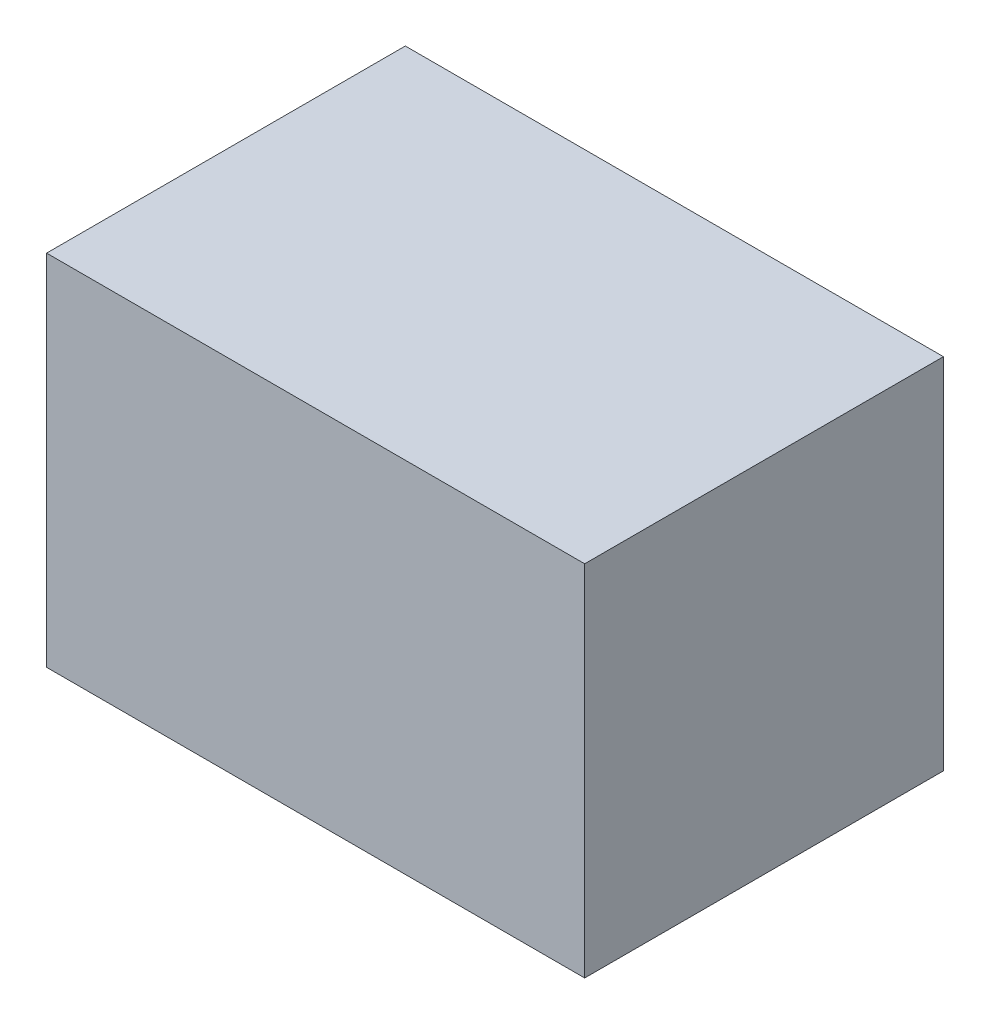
from build123d import *

# Parameters (mm, degrees)
SKETCH_1_W      = 15
SKETCH_1_H      = 10
EXTRUDE_1_DEPTH = 10


with BuildPart() as part:
    # Sketch 1 → Extrude 1 (new body)
    with BuildSketch(Plane(origin=(0, 0, 0), x_dir=(1, 0, 0), z_dir=(0, 1, 0))):
        with Locations((7.5, 5)):
            Rectangle(SKETCH_1_W, SKETCH_1_H)
    extrude(amount=EXTRUDE_1_DEPTH)


solid = part.part
